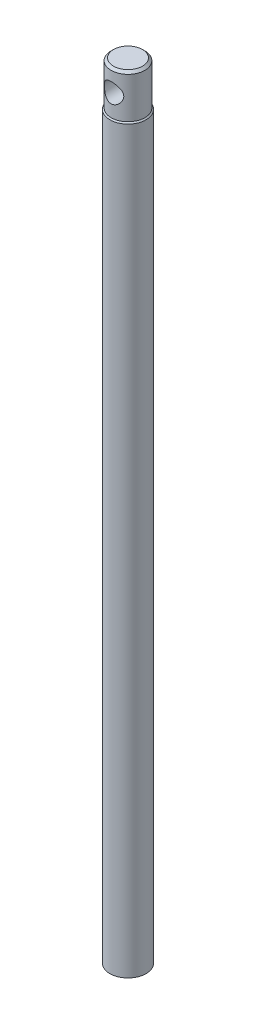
ISO-10303-21;
HEADER;
FILE_DESCRIPTION(('STEP AP214'),'2;1');
FILE_NAME('part.step','',(''),(''),'','','');
FILE_SCHEMA(('AUTOMOTIVE_DESIGN { 1 0 10303 214 1 1 1 1 }'));
ENDSEC;
DATA;
#1=APPLICATION_CONTEXT('core data for automotive mechanical design processes');
#2=APPLICATION_PROTOCOL_DEFINITION('international standard','automotive_design',2000,#1);
#3=PRODUCT_CONTEXT('',#1,'mechanical');
#4=PRODUCT('Part','Part','',(#3));
#5=PRODUCT_RELATED_PRODUCT_CATEGORY('part','',(#4));
#6=PRODUCT_DEFINITION_FORMATION('','',#4);
#7=PRODUCT_DEFINITION_CONTEXT('part definition',#1,'design');
#8=PRODUCT_DEFINITION('design','',#6,#7);
#9=PRODUCT_DEFINITION_SHAPE('','',#8);
#10=(LENGTH_UNIT() NAMED_UNIT(*) SI_UNIT(.MILLI.,.METRE.));
#11=(NAMED_UNIT(*) PLANE_ANGLE_UNIT() SI_UNIT($,.RADIAN.));
#12=(NAMED_UNIT(*) SI_UNIT($,.STERADIAN.) SOLID_ANGLE_UNIT());
#13=UNCERTAINTY_MEASURE_WITH_UNIT(LENGTH_MEASURE(1.E-05),#10,'distance_accuracy_value','');
#14=(GEOMETRIC_REPRESENTATION_CONTEXT(3) GLOBAL_UNCERTAINTY_ASSIGNED_CONTEXT((#13)) GLOBAL_UNIT_ASSIGNED_CONTEXT((#10,
#11,#12)) REPRESENTATION_CONTEXT('',''));
#15=CARTESIAN_POINT('',(0.,0.,0.));
#16=DIRECTION('',(0.,0.,1.));
#17=DIRECTION('',(1.,0.,0.));
#18=AXIS2_PLACEMENT_3D('',#15,#16,#17);
#19=CARTESIAN_POINT('',(0.,614.,0.));
#20=DIRECTION('',(0.,-1.,0.));
#21=DIRECTION('',(0.,0.,-1.));
#22=AXIS2_PLACEMENT_3D('',#19,#20,#21);
#23=CYLINDRICAL_SURFACE('',#22,15.);
#24=CARTESIAN_POINT('',(0.,613.,0.));
#25=DIRECTION('',(0.,1.,0.));
#26=DIRECTION('',(0.,0.,1.));
#27=AXIS2_PLACEMENT_3D('',#24,#25,#26);
#28=CIRCLE('',#27,15.);
#29=CARTESIAN_POINT('',(0.,613.,15.));
#30=VERTEX_POINT('',#29);
#31=EDGE_CURVE('E10',#30,#30,#28,.F.);
#32=ORIENTED_EDGE('',*,*,#31,.T.);
#33=EDGE_LOOP('',(#32));
#34=FACE_BOUND('',#33,.T.);
#35=CARTESIAN_POINT('',(0.,0.,0.));
#36=DIRECTION('',(0.,1.,0.));
#37=DIRECTION('',(0.,0.,1.));
#38=AXIS2_PLACEMENT_3D('',#35,#36,#37);
#39=CIRCLE('',#38,15.);
#40=CARTESIAN_POINT('',(0.,0.,15.));
#41=VERTEX_POINT('',#40);
#42=EDGE_CURVE('E85',#41,#41,#39,.T.);
#43=ORIENTED_EDGE('',*,*,#42,.T.);
#44=EDGE_LOOP('',(#43));
#45=FACE_BOUND('',#44,.T.);
#46=ADVANCED_FACE('F29',(#34,#45),#23,.T.);
#47=CARTESIAN_POINT('',(0.,0.,0.));
#48=DIRECTION('',(0.,1.,0.));
#49=DIRECTION('',(0.,0.,1.));
#50=AXIS2_PLACEMENT_3D('',#47,#48,#49);
#51=PLANE('',#50);
#52=ORIENTED_EDGE('',*,*,#42,.F.);
#53=EDGE_LOOP('',(#52));
#54=FACE_BOUND('',#53,.T.);
#55=ADVANCED_FACE('F74',(#54),#51,.F.);
#56=CARTESIAN_POINT('',(0.,650.,0.));
#57=DIRECTION('',(0.,-1.,0.));
#58=DIRECTION('',(0.,0.,-1.));
#59=AXIS2_PLACEMENT_3D('',#56,#57,#58);
#60=CYLINDRICAL_SURFACE('',#59,14.);
#61=CARTESIAN_POINT('',(0.,640.,-14.));
#62=CARTESIAN_POINT('',(-0.206348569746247,639.999998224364,-13.9999983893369));
#63=CARTESIAN_POINT('',(-0.412761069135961,639.992003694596,-13.9954259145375));
#64=CARTESIAN_POINT('',(-0.824045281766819,639.960121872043,-13.9772448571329));
#65=CARTESIAN_POINT('',(-1.02891595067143,639.93622464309,-13.9636306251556));
#66=CARTESIAN_POINT('',(-1.43586653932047,639.87278694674,-13.9276735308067));
#67=CARTESIAN_POINT('',(-1.63794007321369,639.83321535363,-13.905313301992));
#68=CARTESIAN_POINT('',(-2.03750144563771,639.738911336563,-13.8524086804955));
#69=CARTESIAN_POINT('',(-2.23498729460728,639.684172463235,-13.8218608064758));
#70=CARTESIAN_POINT('',(-2.62298662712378,639.560501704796,-13.753492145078));
#71=CARTESIAN_POINT('',(-2.81353117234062,639.491645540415,-13.7157102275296));
#72=CARTESIAN_POINT('',(-3.18771602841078,639.340246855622,-13.6336047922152));
#73=CARTESIAN_POINT('',(-3.37135364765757,639.257699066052,-13.5892787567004));
#74=CARTESIAN_POINT('',(-3.73061544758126,639.079735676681,-13.4950716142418));
#75=CARTESIAN_POINT('',(-3.90624557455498,638.984329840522,-13.4451947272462));
#76=CARTESIAN_POINT('',(-4.24892051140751,638.781325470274,-13.3408700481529));
#77=CARTESIAN_POINT('',(-4.41596212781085,638.673722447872,-13.2864205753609));
#78=CARTESIAN_POINT('',(-4.92653976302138,638.317382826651,-13.1097143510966));
#79=CARTESIAN_POINT('',(-5.2536701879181,638.047861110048,-12.9810637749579));
#80=CARTESIAN_POINT('',(-5.8607438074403,637.46169153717,-12.7185432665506));
#81=CARTESIAN_POINT('',(-6.1406308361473,637.144988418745,-12.5846673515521));
#82=CARTESIAN_POINT('',(-6.53509669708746,636.620321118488,-12.3821492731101));
#83=CARTESIAN_POINT('',(-6.66779804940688,636.426714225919,-12.3109985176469));
#84=CARTESIAN_POINT('',(-6.91633609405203,636.027355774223,-12.1731044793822));
#85=CARTESIAN_POINT('',(-7.03217039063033,635.82160249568,-12.1063618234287));
#86=CARTESIAN_POINT('',(-7.24576794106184,635.399233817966,-11.9797436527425));
#87=CARTESIAN_POINT('',(-7.34355336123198,635.182632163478,-11.9198597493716));
#88=CARTESIAN_POINT('',(-7.52008119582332,634.739560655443,-11.8092862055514));
#89=CARTESIAN_POINT('',(-7.59882985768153,634.513094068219,-11.7585935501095));
#90=CARTESIAN_POINT('',(-7.72092307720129,634.102964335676,-11.6786738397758));
#91=CARTESIAN_POINT('',(-7.76824594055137,633.920918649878,-11.6471790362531));
#92=CARTESIAN_POINT('',(-7.85011626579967,633.552805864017,-11.5921574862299));
#93=CARTESIAN_POINT('',(-7.88466626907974,633.366739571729,-11.5686291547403));
#94=CARTESIAN_POINT('',(-7.94052951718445,632.991899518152,-11.5303573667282));
#95=CARTESIAN_POINT('',(-7.96185450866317,632.803128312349,-11.5156061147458));
#96=CARTESIAN_POINT('',(-7.99101531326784,632.424040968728,-11.4953900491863));
#97=CARTESIAN_POINT('',(-7.99885085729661,632.233724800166,-11.4899254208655));
#98=CARTESIAN_POINT('',(-8.00091560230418,631.852723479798,-11.4884877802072));
#99=CARTESIAN_POINT('',(-7.99512629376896,631.66203817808,-11.4925276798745));
#100=CARTESIAN_POINT('',(-7.9699902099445,631.282000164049,-11.5099733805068));
#101=CARTESIAN_POINT('',(-7.95064338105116,631.092647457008,-11.5233792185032));
#102=CARTESIAN_POINT('',(-7.89866004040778,630.716557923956,-11.5590725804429));
#103=CARTESIAN_POINT('',(-7.86601830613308,630.529822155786,-11.5813635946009));
#104=CARTESIAN_POINT('',(-7.78785800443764,630.160169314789,-11.6340656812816));
#105=CARTESIAN_POINT('',(-7.74233423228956,629.977253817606,-11.6644800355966));
#106=CARTESIAN_POINT('',(-7.63915938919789,629.617107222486,-11.7323072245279));
#107=CARTESIAN_POINT('',(-7.58156210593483,629.439854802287,-11.7696889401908));
#108=CARTESIAN_POINT('',(-7.45466636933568,629.090974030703,-11.8504684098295));
#109=CARTESIAN_POINT('',(-7.38536407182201,628.919347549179,-11.8938681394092));
#110=CARTESIAN_POINT('',(-7.16074505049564,628.413972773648,-12.0313994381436));
#111=CARTESIAN_POINT('',(-6.98866463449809,628.08955148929,-12.1328984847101));
#112=CARTESIAN_POINT('',(-6.57289990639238,627.420018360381,-12.3637369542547));
#113=CARTESIAN_POINT('',(-6.32216008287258,627.079922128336,-12.4949312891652));
#114=CARTESIAN_POINT('',(-5.90887064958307,626.602813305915,-12.6928615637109));
#115=CARTESIAN_POINT('',(-5.76479012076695,626.44918122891,-12.7590776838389));
#116=CARTESIAN_POINT('',(-5.46465971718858,626.153474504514,-12.8904731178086));
#117=CARTESIAN_POINT('',(-5.30860782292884,626.011401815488,-12.9556522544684));
#118=CARTESIAN_POINT('',(-4.96665948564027,625.724036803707,-13.0908307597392));
#119=CARTESIAN_POINT('',(-4.77939056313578,625.580232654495,-13.1605295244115));
#120=CARTESIAN_POINT('',(-4.39172346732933,625.309059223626,-13.2949173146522));
#121=CARTESIAN_POINT('',(-4.19133066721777,625.181683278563,-13.3596083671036));
#122=CARTESIAN_POINT('',(-3.77846083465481,624.944513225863,-13.482195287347));
#123=CARTESIAN_POINT('',(-3.56598639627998,624.834715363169,-13.5400926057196));
#124=CARTESIAN_POINT('',(-3.13027267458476,624.633935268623,-13.6474066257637));
#125=CARTESIAN_POINT('',(-2.9070347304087,624.542950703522,-13.6968243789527));
#126=CARTESIAN_POINT('',(-2.46720514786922,624.386620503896,-13.782582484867));
#127=CARTESIAN_POINT('',(-2.25121893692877,624.319938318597,-13.8195902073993));
#128=CARTESIAN_POINT('',(-1.81300143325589,624.204852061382,-13.8838773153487));
#129=CARTESIAN_POINT('',(-1.59077036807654,624.156447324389,-13.9111570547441));
#130=CARTESIAN_POINT('',(-1.14215203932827,624.078682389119,-13.9551511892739));
#131=CARTESIAN_POINT('',(-0.915768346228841,624.049306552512,-13.971874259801));
#132=CARTESIAN_POINT('',(-0.460783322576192,624.010018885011,-13.9942678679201));
#133=CARTESIAN_POINT('',(-0.232182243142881,624.000104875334,-13.9999396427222));
#134=CARTESIAN_POINT('',(0.197229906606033,623.99990937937,-14.0000521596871));
#135=CARTESIAN_POINT('',(0.398044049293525,624.007389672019,-13.9957732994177));
#136=CARTESIAN_POINT('',(0.79817921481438,624.037390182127,-13.9786623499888));
#137=CARTESIAN_POINT('',(0.997500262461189,624.059910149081,-13.9658304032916));
#138=CARTESIAN_POINT('',(1.39318738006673,624.119703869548,-13.93192242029));
#139=CARTESIAN_POINT('',(1.58955358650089,624.156976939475,-13.9108467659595));
#140=CARTESIAN_POINT('',(1.97801220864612,624.245828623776,-13.8609460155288));
#141=CARTESIAN_POINT('',(2.17010449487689,624.29740767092,-13.832120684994));
#142=CARTESIAN_POINT('',(2.54683230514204,624.413690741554,-13.7677074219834));
#143=CARTESIAN_POINT('',(2.73152507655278,624.478250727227,-13.7321939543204));
#144=CARTESIAN_POINT('',(3.09459684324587,624.620195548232,-13.6549618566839));
#145=CARTESIAN_POINT('',(3.27297372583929,624.697584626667,-13.6132411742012));
#146=CARTESIAN_POINT('',(3.79723591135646,624.947994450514,-13.4800104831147));
#147=CARTESIAN_POINT('',(4.13251492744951,625.139339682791,-13.3803852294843));
#148=CARTESIAN_POINT('',(4.80208853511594,625.587585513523,-13.1558943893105));
#149=CARTESIAN_POINT('',(5.13264806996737,625.849236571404,-13.0294809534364));
#150=CARTESIAN_POINT('',(5.74791024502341,626.419887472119,-12.7700045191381));
#151=CARTESIAN_POINT('',(6.0325596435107,626.728941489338,-12.6369340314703));
#152=CARTESIAN_POINT('',(6.43570879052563,627.24225706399,-12.4341380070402));
#153=CARTESIAN_POINT('',(6.57188486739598,627.43216101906,-12.3625073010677));
#154=CARTESIAN_POINT('',(6.8277213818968,627.824238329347,-12.223068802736));
#155=CARTESIAN_POINT('',(6.94737945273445,628.026413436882,-12.1552615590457));
#156=CARTESIAN_POINT('',(7.16901974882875,628.441835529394,-12.0258731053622));
#157=CARTESIAN_POINT('',(7.2710208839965,628.65507034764,-11.9642852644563));
#158=CARTESIAN_POINT('',(7.45639687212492,629.091677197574,-11.8496427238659));
#159=CARTESIAN_POINT('',(7.53977744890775,629.315046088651,-11.7965854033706));
#160=CARTESIAN_POINT('',(7.67107664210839,629.721838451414,-11.711504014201));
#161=CARTESIAN_POINT('',(7.7227657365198,629.903619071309,-11.6774075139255));
#162=CARTESIAN_POINT('',(7.81335379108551,630.271594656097,-11.616990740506));
#163=CARTESIAN_POINT('',(7.85225531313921,630.457788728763,-11.5906689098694));
#164=CARTESIAN_POINT('',(7.91675948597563,630.833305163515,-11.5467071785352));
#165=CARTESIAN_POINT('',(7.94237461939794,631.02262441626,-11.5290591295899));
#166=CARTESIAN_POINT('',(7.98000413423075,631.403255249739,-11.5030457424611));
#167=CARTESIAN_POINT('',(7.9920183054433,631.594566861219,-11.4946805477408));
#168=CARTESIAN_POINT('',(8.00227476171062,631.978128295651,-11.4875427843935));
#169=CARTESIAN_POINT('',(8.00048910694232,632.170379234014,-11.4887896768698));
#170=CARTESIAN_POINT('',(7.98310713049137,632.553948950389,-11.5008743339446));
#171=CARTESIAN_POINT('',(7.9675107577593,632.745267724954,-11.5117121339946));
#172=CARTESIAN_POINT('',(7.9227269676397,633.125653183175,-11.5425791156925));
#173=CARTESIAN_POINT('',(7.89353221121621,633.314718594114,-11.5626132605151));
#174=CARTESIAN_POINT('',(7.82194996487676,633.689215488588,-11.6111568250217));
#175=CARTESIAN_POINT('',(7.7795622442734,633.87464690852,-11.6396663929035));
#176=CARTESIAN_POINT('',(7.68296440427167,634.237564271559,-11.7036468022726));
#177=CARTESIAN_POINT('',(7.62897591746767,634.415132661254,-11.7389860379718));
#178=CARTESIAN_POINT('',(7.50928940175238,634.764917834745,-11.8159056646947));
#179=CARTESIAN_POINT('',(7.443587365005,634.937132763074,-11.8574881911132));
#180=CARTESIAN_POINT('',(7.2297490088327,635.444623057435,-11.9899488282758));
#181=CARTESIAN_POINT('',(7.06482957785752,635.7709324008,-12.0885751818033));
#182=CARTESIAN_POINT('',(6.66567889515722,636.443462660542,-12.3137638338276));
#183=CARTESIAN_POINT('',(6.42468511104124,636.785012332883,-12.4422892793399));
#184=CARTESIAN_POINT('',(6.02639848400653,637.265539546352,-12.6374254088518));
#185=CARTESIAN_POINT('',(5.88738664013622,637.420519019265,-12.7029116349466));
#186=CARTESIAN_POINT('',(5.59751359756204,637.719367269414,-12.833279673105));
#187=CARTESIAN_POINT('',(5.44665053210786,637.863234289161,-12.8981613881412));
#188=CARTESIAN_POINT('',(5.11411257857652,638.156373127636,-13.0338791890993));
#189=CARTESIAN_POINT('',(4.93094253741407,638.304076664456,-13.104447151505));
#190=CARTESIAN_POINT('',(4.55126649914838,638.583425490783,-13.2410972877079));
#191=CARTESIAN_POINT('',(4.35476536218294,638.715076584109,-13.3071810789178));
#192=CARTESIAN_POINT('',(3.94939436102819,638.961214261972,-13.4330681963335));
#193=CARTESIAN_POINT('',(3.74052570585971,639.075702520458,-13.4928721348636));
#194=CARTESIAN_POINT('',(3.3116915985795,639.286269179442,-13.6044751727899));
#195=CARTESIAN_POINT('',(3.09172922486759,639.382352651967,-13.6562764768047));
#196=CARTESIAN_POINT('',(2.68225390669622,639.539542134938,-13.7419492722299));
#197=CARTESIAN_POINT('',(2.49428044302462,639.603829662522,-13.7773711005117));
#198=CARTESIAN_POINT('',(2.1129540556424,639.718487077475,-13.8409813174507));
#199=CARTESIAN_POINT('',(1.91960209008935,639.768859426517,-13.8691709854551));
#200=CARTESIAN_POINT('',(1.5292083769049,639.855023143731,-13.9176191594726));
#201=CARTESIAN_POINT('',(1.33217688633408,639.890850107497,-13.9378970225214));
#202=CARTESIAN_POINT('',(0.935388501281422,639.947651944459,-13.9701331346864));
#203=CARTESIAN_POINT('',(0.735633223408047,639.968635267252,-13.982096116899));
#204=CARTESIAN_POINT('',(0.446226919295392,639.988044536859,-13.9931711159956));
#205=CARTESIAN_POINT('',(0.357068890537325,639.992525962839,-13.9957302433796));
#206=CARTESIAN_POINT('',(0.1786112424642,639.998504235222,-13.9991451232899));
#207=CARTESIAN_POINT('',(0.0893116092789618,640.000000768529,-14.0000006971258));
#208=CARTESIAN_POINT('',(0.,640.,-14.));
#209=B_SPLINE_CURVE_WITH_KNOTS('',3,(#61,#62,#63,#64,#65,#66,#67,#68,#69,#70,#71,#72,#73,#74,
#75,#76,#77,#78,#79,#80,#81,#82,#83,#84,#85,#86,#87,#88,#89,#90,#91,#92,#93,#94,#95,#96,#97,#98,
#99,#100,#101,#102,#103,#104,#105,#106,#107,#108,#109,#110,#111,#112,#113,#114,#115,#116,#117,
#118,#119,#120,#121,#122,#123,#124,#125,#126,#127,#128,#129,#130,#131,#132,#133,#134,#135,#136,
#137,#138,#139,#140,#141,#142,#143,#144,#145,#146,#147,#148,#149,#150,#151,#152,#153,#154,#155,
#156,#157,#158,#159,#160,#161,#162,#163,#164,#165,#166,#167,#168,#169,#170,#171,#172,#173,#174,
#175,#176,#177,#178,#179,#180,#181,#182,#183,#184,#185,#186,#187,#188,#189,#190,#191,#192,#193,
#194,#195,#196,#197,#198,#199,#200,#201,#202,#203,#204,#205,#206,#207,#208),.UNSPECIFIED.,.T.,
.F.,(4,2,2,2,2,2,2,2,2,2,2,2,2,2,2,2,2,2,2,2,2,2,2,2,2,2,2,2,2,2,2,2,2,2,2,2,2,2,2,2,2,2,2,2,2,
2,2,2,2,2,2,2,2,2,2,2,2,2,2,2,2,2,2,2,2,2,2,2,2,2,2,2,2,4),(0.,0.618952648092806,
1.23829238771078,1.85886821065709,2.47970831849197,3.09730168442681,3.71513328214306,
4.33249835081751,4.95009133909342,6.27331436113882,7.59809960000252,8.33311841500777,
9.0682415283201,9.80245572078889,10.5364286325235,11.1079866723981,11.6794309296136,
12.2503668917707,12.8213142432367,13.3930376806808,13.9647633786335,14.5367138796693,
15.1088957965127,15.6785808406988,16.2484533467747,17.3876388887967,18.7093804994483,
19.3712344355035,20.0332002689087,20.7708303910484,21.5081603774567,22.2453326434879,
22.9824134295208,23.6685994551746,24.3547605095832,25.0403569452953,25.7258766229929,
26.3281366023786,26.9303865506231,27.5326085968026,28.1348488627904,28.7307427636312,
29.3268341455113,30.51819001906,31.8335529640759,33.150430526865,33.8829267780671,
34.6155278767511,35.3473394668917,36.0789257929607,36.6544565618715,37.2298719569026,
37.8047457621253,38.3796284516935,38.9556753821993,39.5317244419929,40.1080847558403,
40.684455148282,41.2506628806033,41.8170647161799,42.9492792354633,44.2558389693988,
44.910091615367,45.5644475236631,46.3005113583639,47.0363082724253,47.7720333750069,
48.507555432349,49.1123054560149,49.716948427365,50.3201026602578,50.9229132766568,
51.190779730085,51.4586742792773),.UNSPECIFIED.);
#210=CARTESIAN_POINT('',(0.,640.,-14.));
#211=VERTEX_POINT('',#210);
#212=EDGE_CURVE('E32',#211,#211,#209,.T.);
#213=ORIENTED_EDGE('',*,*,#212,.T.);
#214=EDGE_LOOP('',(#213));
#215=FACE_BOUND('',#214,.T.);
#216=CARTESIAN_POINT('',(8.00000000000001,632.,11.4891252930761));
#217=CARTESIAN_POINT('',(7.99999935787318,631.796467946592,11.489126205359));
#218=CARTESIAN_POINT('',(7.99222093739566,631.592926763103,11.494553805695));
#219=CARTESIAN_POINT('',(7.96123805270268,631.187587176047,11.5160338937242));
#220=CARTESIAN_POINT('',(7.93803253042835,630.985788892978,11.5320871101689));
#221=CARTESIAN_POINT('',(7.87655003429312,630.585429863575,11.5741669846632));
#222=CARTESIAN_POINT('',(7.83826277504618,630.386871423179,11.6002004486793));
#223=CARTESIAN_POINT('',(7.74715252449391,629.994450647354,11.6612446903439));
#224=CARTESIAN_POINT('',(7.69432282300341,629.800590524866,11.6962596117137));
#225=CARTESIAN_POINT('',(7.57521099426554,629.420148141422,11.7737497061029));
#226=CARTESIAN_POINT('',(7.50902563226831,629.233524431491,11.8161709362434));
#227=CARTESIAN_POINT('',(7.3636236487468,628.866958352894,11.9073259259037));
#228=CARTESIAN_POINT('',(7.28440218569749,628.68701849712,11.9560620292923));
#229=CARTESIAN_POINT('',(7.11357880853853,628.334576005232,12.0584782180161));
#230=CARTESIAN_POINT('',(7.02197688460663,628.162073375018,12.1121583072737));
#231=CARTESIAN_POINT('',(6.82702919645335,627.825122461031,12.2231048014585));
#232=CARTESIAN_POINT('',(6.72368303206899,627.660674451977,12.280371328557));
#233=CARTESIAN_POINT('',(6.37278986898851,627.144872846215,12.4684628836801));
#234=CARTESIAN_POINT('',(6.10292894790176,626.809843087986,12.6039221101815));
#235=CARTESIAN_POINT('',(5.66068633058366,626.342901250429,12.8055879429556));
#236=CARTESIAN_POINT('',(5.50691703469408,626.193101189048,12.8725995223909));
#237=CARTESIAN_POINT('',(5.18728463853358,625.905888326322,13.0046887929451));
#238=CARTESIAN_POINT('',(5.02141944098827,625.768477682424,13.0697661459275));
#239=CARTESIAN_POINT('',(4.66194414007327,625.494454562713,13.2025153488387));
#240=CARTESIAN_POINT('',(4.46719629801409,625.359165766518,13.269843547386));
#241=CARTESIAN_POINT('',(4.0650969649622,625.105695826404,13.3984892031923));
#242=CARTESIAN_POINT('',(3.85775108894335,624.987507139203,13.4598093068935));
#243=CARTESIAN_POINT('',(3.43166945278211,624.769447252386,13.5746936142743));
#244=CARTESIAN_POINT('',(3.2129379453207,624.669569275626,13.628260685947));
#245=CARTESIAN_POINT('',(2.76555609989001,624.489352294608,13.7260371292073));
#246=CARTESIAN_POINT('',(2.53690721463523,624.409010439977,13.7702478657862));
#247=CARTESIAN_POINT('',(2.09214757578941,624.275235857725,13.844463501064));
#248=CARTESIAN_POINT('',(1.87671473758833,624.220052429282,13.8753785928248));
#249=CARTESIAN_POINT('',(1.44085379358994,624.127671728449,13.9273863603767));
#250=CARTESIAN_POINT('',(1.22042595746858,624.090473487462,13.948479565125));
#251=CARTESIAN_POINT('',(0.776637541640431,624.034648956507,13.9802106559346));
#252=CARTESIAN_POINT('',(0.553279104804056,624.016009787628,13.9908557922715));
#253=CARTESIAN_POINT('',(0.105540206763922,623.997559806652,14.0013923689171));
#254=CARTESIAN_POINT('',(-0.118840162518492,623.997747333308,14.0012847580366));
#255=CARTESIAN_POINT('',(-0.541204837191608,624.015852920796,13.9909458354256));
#256=CARTESIAN_POINT('',(-0.739307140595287,624.031765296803,13.981859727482));
#257=CARTESIAN_POINT('',(-1.13324065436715,624.078188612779,13.9554551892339));
#258=CARTESIAN_POINT('',(-1.32907186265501,624.108699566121,13.9381367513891));
#259=CARTESIAN_POINT('',(-1.71710436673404,624.183951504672,13.8956702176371));
#260=CARTESIAN_POINT('',(-1.90930571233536,624.228692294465,13.8705222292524));
#261=CARTESIAN_POINT('',(-2.28886889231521,624.331899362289,13.8129625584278));
#262=CARTESIAN_POINT('',(-2.47623053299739,624.390366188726,13.7805505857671));
#263=CARTESIAN_POINT('',(-2.8466367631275,624.520992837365,13.708848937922));
#264=CARTESIAN_POINT('',(-3.02963027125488,624.593266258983,13.6695024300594));
#265=CARTESIAN_POINT('',(-3.38869989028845,624.750505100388,13.5849474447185));
#266=CARTESIAN_POINT('',(-3.56477365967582,624.835474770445,13.5397370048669));
#267=CARTESIAN_POINT('',(-4.08133031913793,625.108394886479,13.3966451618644));
#268=CARTESIAN_POINT('',(-4.41038459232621,625.314440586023,13.291255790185));
#269=CARTESIAN_POINT('',(-5.06776505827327,625.794995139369,13.0557768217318));
#270=CARTESIAN_POINT('',(-5.39180398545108,626.07461029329,12.9242417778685));
#271=CARTESIAN_POINT('',(-5.99118151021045,626.681385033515,12.6575416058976));
#272=CARTESIAN_POINT('',(-6.26646020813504,627.008602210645,12.5223722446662));
#273=CARTESIAN_POINT('',(-6.6510318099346,627.548131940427,12.3202140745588));
#274=CARTESIAN_POINT('',(-6.77929998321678,627.745946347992,12.2498990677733));
#275=CARTESIAN_POINT('',(-7.01858679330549,628.153540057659,12.1143846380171));
#276=CARTESIAN_POINT('',(-7.12960303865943,628.363321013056,12.049185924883));
#277=CARTESIAN_POINT('',(-7.33310792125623,628.793434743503,11.9264265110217));
#278=CARTESIAN_POINT('',(-7.42562347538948,629.01375160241,11.8688547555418));
#279=CARTESIAN_POINT('',(-7.59114644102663,629.463873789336,11.7636783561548));
#280=CARTESIAN_POINT('',(-7.66416067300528,629.69367576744,11.7160702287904));
#281=CARTESIAN_POINT('',(-7.77516436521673,630.107479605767,11.6426014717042));
#282=CARTESIAN_POINT('',(-7.81734535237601,630.289926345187,11.6142572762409));
#283=CARTESIAN_POINT('',(-7.88893043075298,630.658369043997,11.5657535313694));
#284=CARTESIAN_POINT('',(-7.91833702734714,630.844364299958,11.5455923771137));
#285=CARTESIAN_POINT('',(-7.96397245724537,631.218564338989,11.5141614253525));
#286=CARTESIAN_POINT('',(-7.9802117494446,631.406767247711,11.5028845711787));
#287=CARTESIAN_POINT('',(-7.99932030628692,631.784186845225,11.4896045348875));
#288=CARTESIAN_POINT('',(-8.00218923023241,631.973403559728,11.4876015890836));
#289=CARTESIAN_POINT('',(-7.99451086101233,632.351536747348,11.4929464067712));
#290=CARTESIAN_POINT('',(-7.98395601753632,632.540452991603,11.5002994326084));
#291=CARTESIAN_POINT('',(-7.94957218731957,632.91648864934,11.5240936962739));
#292=CARTESIAN_POINT('',(-7.92574315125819,633.103608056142,11.5405349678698));
#293=CARTESIAN_POINT('',(-7.86512609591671,633.474850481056,11.5819313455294));
#294=CARTESIAN_POINT('',(-7.82833257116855,633.658972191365,11.6068900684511));
#295=CARTESIAN_POINT('',(-7.74222786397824,634.023098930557,11.6645011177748));
#296=CARTESIAN_POINT('',(-7.692911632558,634.203102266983,11.6971565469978));
#297=CARTESIAN_POINT('',(-7.58162634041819,634.560141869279,11.7695963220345));
#298=CARTESIAN_POINT('',(-7.51951208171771,634.737116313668,11.8094617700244));
#299=CARTESIAN_POINT('',(-7.38356659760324,635.085103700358,11.89493119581));
#300=CARTESIAN_POINT('',(-7.30973150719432,635.256114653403,11.9405370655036));
#301=CARTESIAN_POINT('',(-7.07149845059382,635.759196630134,12.0842173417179));
#302=CARTESIAN_POINT('',(-6.89032049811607,636.081482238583,12.1891898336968));
#303=CARTESIAN_POINT('',(-6.45360047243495,636.74708039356,12.4266823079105));
#304=CARTESIAN_POINT('',(-6.19070291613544,637.084980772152,12.5608806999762));
#305=CARTESIAN_POINT('',(-5.75872693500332,637.557219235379,12.7617574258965));
#306=CARTESIAN_POINT('',(-5.6083374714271,637.708963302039,12.8286958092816));
#307=CARTESIAN_POINT('',(-5.2954564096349,638.000318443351,12.9609780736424));
#308=CARTESIAN_POINT('',(-5.13296281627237,638.139927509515,13.0263216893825));
#309=CARTESIAN_POINT('',(-4.77965918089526,638.419546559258,13.1603209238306));
#310=CARTESIAN_POINT('',(-4.58764366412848,638.55819250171,13.2286514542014));
#311=CARTESIAN_POINT('',(-4.1907893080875,638.818620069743,13.3596752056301));
#312=CARTESIAN_POINT('',(-3.98595600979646,638.940408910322,13.4223708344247));
#313=CARTESIAN_POINT('',(-3.56462133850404,639.165929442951,13.5403586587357));
#314=CARTESIAN_POINT('',(-3.34812405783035,639.26966741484,13.5956534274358));
#315=CARTESIAN_POINT('',(-2.90486806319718,639.457860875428,13.6972044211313));
#316=CARTESIAN_POINT('',(-2.67811077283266,639.542319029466,13.7434618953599));
#317=CARTESIAN_POINT('',(-2.23495150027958,639.684703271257,13.8221359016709));
#318=CARTESIAN_POINT('',(-2.01920900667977,639.744229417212,13.8553725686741));
#319=CARTESIAN_POINT('',(-1.58225574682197,639.845172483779,13.9120445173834));
#320=CARTESIAN_POINT('',(-1.3610452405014,639.886590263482,13.9354802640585));
#321=CARTESIAN_POINT('',(-0.915231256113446,639.950662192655,13.9718407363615));
#322=CARTESIAN_POINT('',(-0.690630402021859,639.97333016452,13.9847732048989));
#323=CARTESIAN_POINT('',(-0.239962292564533,639.999584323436,13.9997581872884));
#324=CARTESIAN_POINT('',(-0.0138951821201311,640.003172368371,14.0018117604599));
#325=CARTESIAN_POINT('',(0.411213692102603,639.991915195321,13.9953813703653));
#326=CARTESIAN_POINT('',(0.610333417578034,639.979170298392,13.988098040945));
#327=CARTESIAN_POINT('',(1.00659085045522,639.93891865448,13.9651764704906));
#328=CARTESIAN_POINT('',(1.20372856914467,639.911411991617,13.9495382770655));
#329=CARTESIAN_POINT('',(1.59462422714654,639.841975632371,13.9102754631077));
#330=CARTESIAN_POINT('',(1.78838225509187,639.800046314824,13.8866510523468));
#331=CARTESIAN_POINT('',(2.17126841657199,639.702249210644,13.8319558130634));
#332=CARTESIAN_POINT('',(2.360396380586,639.646380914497,13.8008847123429));
#333=CARTESIAN_POINT('',(2.73316739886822,639.521203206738,13.7319249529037));
#334=CARTESIAN_POINT('',(2.91680257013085,639.451875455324,13.6940269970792));
#335=CARTESIAN_POINT('',(3.27738544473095,639.300481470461,13.612236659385));
#336=CARTESIAN_POINT('',(3.45433089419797,639.218410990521,13.5683422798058));
#337=CARTESIAN_POINT('',(3.97380675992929,638.95410784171,13.4289644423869));
#338=CARTESIAN_POINT('',(4.30522274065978,638.753699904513,13.3257390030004));
#339=CARTESIAN_POINT('',(4.96733530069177,638.285530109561,13.0943490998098));
#340=CARTESIAN_POINT('',(5.29395096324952,638.012786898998,12.9646906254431));
#341=CARTESIAN_POINT('',(5.89958284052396,637.41983313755,12.7005543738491));
#342=CARTESIAN_POINT('',(6.17854141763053,637.099565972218,12.5660709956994));
#343=CARTESIAN_POINT('',(6.57042581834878,636.56996211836,12.363425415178));
#344=CARTESIAN_POINT('',(6.70181247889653,636.375068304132,12.2924998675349));
#345=CARTESIAN_POINT('',(6.94760836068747,635.973183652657,12.1552671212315));
#346=CARTESIAN_POINT('',(7.06201516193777,635.76619109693,12.0889605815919));
#347=CARTESIAN_POINT('',(7.27261222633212,635.34144266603,11.963450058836));
#348=CARTESIAN_POINT('',(7.36882687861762,635.123701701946,11.9042366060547));
#349=CARTESIAN_POINT('',(7.54207213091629,634.678460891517,11.7952378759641));
#350=CARTESIAN_POINT('',(7.61910923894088,634.450964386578,11.7454494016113));
#351=CARTESIAN_POINT('',(7.73744636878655,634.041169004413,11.6677208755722));
#352=CARTESIAN_POINT('',(7.7828906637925,633.860510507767,11.6373895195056));
#353=CARTESIAN_POINT('',(7.86121615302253,633.495368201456,11.5846242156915));
#354=CARTESIAN_POINT('',(7.89409981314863,633.310885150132,11.5621887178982));
#355=CARTESIAN_POINT('',(7.94687101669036,632.939368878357,11.5259823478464));
#356=CARTESIAN_POINT('',(7.96676875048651,632.752337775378,11.5122046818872));
#357=CARTESIAN_POINT('',(7.99333404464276,632.376873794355,11.4937753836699));
#358=CARTESIAN_POINT('',(8.0000005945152,632.188440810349,11.489124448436));
#359=CARTESIAN_POINT('',(8.00000000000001,632.,11.4891252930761));
#360=B_SPLINE_CURVE_WITH_KNOTS('',3,(#216,#217,#218,#219,#220,#221,#222,#223,#224,#225,#226,
#227,#228,#229,#230,#231,#232,#233,#234,#235,#236,#237,#238,#239,#240,#241,#242,#243,#244,#245,
#246,#247,#248,#249,#250,#251,#252,#253,#254,#255,#256,#257,#258,#259,#260,#261,#262,#263,#264,
#265,#266,#267,#268,#269,#270,#271,#272,#273,#274,#275,#276,#277,#278,#279,#280,#281,#282,#283,
#284,#285,#286,#287,#288,#289,#290,#291,#292,#293,#294,#295,#296,#297,#298,#299,#300,#301,#302,
#303,#304,#305,#306,#307,#308,#309,#310,#311,#312,#313,#314,#315,#316,#317,#318,#319,#320,#321,
#322,#323,#324,#325,#326,#327,#328,#329,#330,#331,#332,#333,#334,#335,#336,#337,#338,#339,#340,
#341,#342,#343,#344,#345,#346,#347,#348,#349,#350,#351,#352,#353,#354,#355,#356,#357,#358,#359),
.UNSPECIFIED.,.T.,.F.,(4,2,2,2,2,2,2,2,2,2,2,2,2,2,2,2,2,2,2,2,2,2,2,2,2,2,2,2,2,2,2,2,2,2,2,2,
2,2,2,2,2,2,2,2,2,2,2,2,2,2,2,2,2,2,2,2,2,2,2,2,2,2,2,2,2,2,2,2,2,2,2,4),(0.,0.610394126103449,
1.22083012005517,1.83168313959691,2.44281849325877,3.0496754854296,3.65675837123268,
4.26384173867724,4.87094579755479,6.21753747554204,6.89171864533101,7.56601698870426,
8.30456692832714,9.04279007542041,9.78073943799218,10.5185810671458,11.1912108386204,
11.8638043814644,12.5359308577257,13.2079980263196,13.8041314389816,14.4002653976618,
14.9963911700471,15.5925407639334,16.1938249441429,16.795310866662,17.9975256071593,
19.3356434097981,20.675393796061,21.4126763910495,22.1500610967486,22.8863650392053,
23.6224111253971,24.1899980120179,24.7574735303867,25.3244978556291,25.8915366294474,
26.4588944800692,27.0262544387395,27.5938556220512,28.1616860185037,28.7363534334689,
29.3112107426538,30.4603992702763,31.8006433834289,32.4717642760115,33.1429960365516,
33.8815468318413,34.6197805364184,35.3577568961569,36.0956311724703,36.7734445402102,
37.4512257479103,38.1285068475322,38.8057219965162,39.4039821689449,40.0022389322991,
40.6004799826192,41.1987429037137,41.7978268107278,42.3971107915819,43.5948947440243,
44.9242990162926,46.2552998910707,46.9910662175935,47.7269373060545,48.4618147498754,
49.1964424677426,49.7620901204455,50.3276266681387,50.8927188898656,51.4578542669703),.UNSPECIFIED.);
#361=CARTESIAN_POINT('',(8.00000000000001,632.,11.4891252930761));
#362=VERTEX_POINT('',#361);
#363=EDGE_CURVE('E48',#362,#362,#360,.T.);
#364=ORIENTED_EDGE('',*,*,#363,.T.);
#365=EDGE_LOOP('',(#364));
#366=FACE_BOUND('',#365,.T.);
#367=CARTESIAN_POINT('',(0.,648.,0.));
#368=DIRECTION('',(0.,1.,0.));
#369=DIRECTION('',(0.,0.,1.));
#370=AXIS2_PLACEMENT_3D('',#367,#368,#369);
#371=CIRCLE('',#370,14.);
#372=CARTESIAN_POINT('',(0.,648.,14.));
#373=VERTEX_POINT('',#372);
#374=EDGE_CURVE('E40',#373,#373,#371,.F.);
#375=ORIENTED_EDGE('',*,*,#374,.T.);
#376=EDGE_LOOP('',(#375));
#377=FACE_BOUND('',#376,.T.);
#378=CARTESIAN_POINT('',(0.,614.,0.));
#379=DIRECTION('',(0.,1.,0.));
#380=DIRECTION('',(0.,0.,1.));
#381=AXIS2_PLACEMENT_3D('',#378,#379,#380);
#382=CIRCLE('',#381,14.);
#383=CARTESIAN_POINT('',(0.,614.,14.));
#384=VERTEX_POINT('',#383);
#385=EDGE_CURVE('E86',#384,#384,#382,.T.);
#386=ORIENTED_EDGE('',*,*,#385,.T.);
#387=EDGE_LOOP('',(#386));
#388=FACE_BOUND('',#387,.T.);
#389=ADVANCED_FACE('F52',(#215,#366,#377,#388),#60,.T.);
#390=CARTESIAN_POINT('',(0.,650.,0.));
#391=DIRECTION('',(0.,1.,0.));
#392=DIRECTION('',(0.,0.,1.));
#393=AXIS2_PLACEMENT_3D('',#390,#391,#392);
#394=PLANE('',#393);
#395=CARTESIAN_POINT('',(0.,650.,0.));
#396=DIRECTION('',(0.,1.,0.));
#397=DIRECTION('',(0.,0.,1.));
#398=AXIS2_PLACEMENT_3D('',#395,#396,#397);
#399=CIRCLE('',#398,12.0000000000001);
#400=CARTESIAN_POINT('',(0.,650.,12.0000000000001));
#401=VERTEX_POINT('',#400);
#402=EDGE_CURVE('E45',#401,#401,#399,.T.);
#403=ORIENTED_EDGE('',*,*,#402,.T.);
#404=EDGE_LOOP('',(#403));
#405=FACE_BOUND('',#404,.T.);
#406=ADVANCED_FACE('F67',(#405),#394,.T.);
#407=CARTESIAN_POINT('',(0.,650.,0.));
#408=DIRECTION('',(0.,-1.,0.));
#409=DIRECTION('',(0.,0.,-1.));
#410=AXIS2_PLACEMENT_3D('',#407,#408,#409);
#411=CONICAL_SURFACE('',#410,12.0000000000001,0.785398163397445);
#412=ORIENTED_EDGE('',*,*,#374,.F.);
#413=EDGE_LOOP('',(#412));
#414=FACE_BOUND('',#413,.T.);
#415=ORIENTED_EDGE('',*,*,#402,.F.);
#416=EDGE_LOOP('',(#415));
#417=FACE_BOUND('',#416,.T.);
#418=ADVANCED_FACE('F64',(#414,#417),#411,.T.);
#419=CARTESIAN_POINT('',(0.,614.,0.));
#420=DIRECTION('',(0.,-1.,0.));
#421=DIRECTION('',(0.,0.,-1.));
#422=AXIS2_PLACEMENT_3D('',#419,#420,#421);
#423=CONICAL_SURFACE('',#422,13.9999999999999,0.785398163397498);
#424=ORIENTED_EDGE('',*,*,#31,.F.);
#425=EDGE_LOOP('',(#424));
#426=FACE_BOUND('',#425,.T.);
#427=ORIENTED_EDGE('',*,*,#385,.F.);
#428=EDGE_LOOP('',(#427));
#429=FACE_BOUND('',#428,.T.);
#430=ADVANCED_FACE('F59',(#426,#429),#423,.T.);
#431=CARTESIAN_POINT('',(0.,632.,-15.));
#432=DIRECTION('',(0.,0.,1.));
#433=DIRECTION('',(1.,0.,0.));
#434=AXIS2_PLACEMENT_3D('',#431,#432,#433);
#435=CYLINDRICAL_SURFACE('',#434,8.00000000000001);
#436=ORIENTED_EDGE('',*,*,#363,.F.);
#437=EDGE_LOOP('',(#436));
#438=FACE_BOUND('',#437,.T.);
#439=ORIENTED_EDGE('',*,*,#212,.F.);
#440=EDGE_LOOP('',(#439));
#441=FACE_BOUND('',#440,.T.);
#442=ADVANCED_FACE('F55',(#438,#441),#435,.F.);
#443=CLOSED_SHELL('',(#46,#55,#389,#406,#418,#430,#442));
#444=MANIFOLD_SOLID_BREP('B2',#443);
#445=ADVANCED_BREP_SHAPE_REPRESENTATION('',(#18,#444),#14);
#446=SHAPE_DEFINITION_REPRESENTATION(#9,#445);
ENDSEC;
END-ISO-10303-21;
